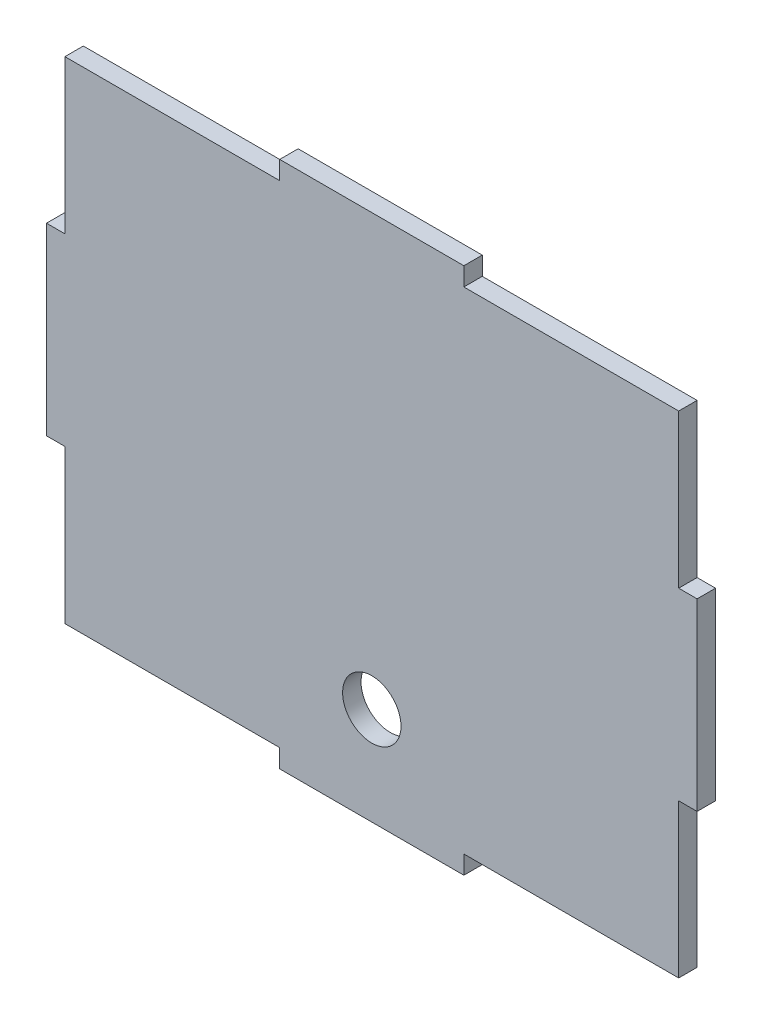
ISO-10303-21;
HEADER;
FILE_DESCRIPTION(('STEP AP214'),'2;1');
FILE_NAME('part.step','',(''),(''),'','','');
FILE_SCHEMA(('AUTOMOTIVE_DESIGN { 1 0 10303 214 1 1 1 1 }'));
ENDSEC;
DATA;
#1=APPLICATION_CONTEXT('core data for automotive mechanical design processes');
#2=APPLICATION_PROTOCOL_DEFINITION('international standard','automotive_design',2000,#1);
#3=PRODUCT_CONTEXT('',#1,'mechanical');
#4=PRODUCT('Part','Part','',(#3));
#5=PRODUCT_RELATED_PRODUCT_CATEGORY('part','',(#4));
#6=PRODUCT_DEFINITION_FORMATION('','',#4);
#7=PRODUCT_DEFINITION_CONTEXT('part definition',#1,'design');
#8=PRODUCT_DEFINITION('design','',#6,#7);
#9=PRODUCT_DEFINITION_SHAPE('','',#8);
#10=(LENGTH_UNIT() NAMED_UNIT(*) SI_UNIT(.MILLI.,.METRE.));
#11=(NAMED_UNIT(*) PLANE_ANGLE_UNIT() SI_UNIT($,.RADIAN.));
#12=(NAMED_UNIT(*) SI_UNIT($,.STERADIAN.) SOLID_ANGLE_UNIT());
#13=UNCERTAINTY_MEASURE_WITH_UNIT(LENGTH_MEASURE(1.E-05),#10,'distance_accuracy_value','');
#14=(GEOMETRIC_REPRESENTATION_CONTEXT(3) GLOBAL_UNCERTAINTY_ASSIGNED_CONTEXT((#13)) GLOBAL_UNIT_ASSIGNED_CONTEXT((#10,
#11,#12)) REPRESENTATION_CONTEXT('',''));
#15=CARTESIAN_POINT('',(0.,0.,0.));
#16=DIRECTION('',(0.,0.,1.));
#17=DIRECTION('',(1.,0.,0.));
#18=AXIS2_PLACEMENT_3D('',#15,#16,#17);
#19=CARTESIAN_POINT('',(0.,0.,3.));
#20=DIRECTION('',(0.,0.,-1.));
#21=DIRECTION('',(-1.,0.,0.));
#22=AXIS2_PLACEMENT_3D('',#19,#20,#21);
#23=PLANE('',#22);
#24=DIRECTION('',(0.,1.,0.));
#25=VECTOR('',#24,1.);
#26=CARTESIAN_POINT('',(50.,15.,3.));
#27=LINE('',#26,#25);
#28=CARTESIAN_POINT('',(50.,15.,3.));
#29=VERTEX_POINT('',#28);
#30=CARTESIAN_POINT('',(50.,40.,3.));
#31=VERTEX_POINT('',#30);
#32=EDGE_CURVE('E241',#29,#31,#27,.T.);
#33=ORIENTED_EDGE('',*,*,#32,.T.);
#34=DIRECTION('',(-1.,0.,0.));
#35=VECTOR('',#34,1.);
#36=CARTESIAN_POINT('',(15.,40.,3.));
#37=LINE('',#36,#35);
#38=CARTESIAN_POINT('',(15.,40.,3.));
#39=VERTEX_POINT('',#38);
#40=EDGE_CURVE('E129',#31,#39,#37,.T.);
#41=ORIENTED_EDGE('',*,*,#40,.T.);
#42=DIRECTION('',(0.,1.,0.));
#43=VECTOR('',#42,1.);
#44=CARTESIAN_POINT('',(15.,40.,3.));
#45=LINE('',#44,#43);
#46=CARTESIAN_POINT('',(15.,43.,3.));
#47=VERTEX_POINT('',#46);
#48=EDGE_CURVE('E292',#39,#47,#45,.T.);
#49=ORIENTED_EDGE('',*,*,#48,.T.);
#50=DIRECTION('',(-1.,0.,0.));
#51=VECTOR('',#50,1.);
#52=CARTESIAN_POINT('',(-15.,43.,3.));
#53=LINE('',#52,#51);
#54=CARTESIAN_POINT('',(-15.,43.,3.));
#55=VERTEX_POINT('',#54);
#56=EDGE_CURVE('E311',#47,#55,#53,.T.);
#57=ORIENTED_EDGE('',*,*,#56,.T.);
#58=DIRECTION('',(0.,-1.,0.));
#59=VECTOR('',#58,1.);
#60=CARTESIAN_POINT('',(-15.,40.,3.));
#61=LINE('',#60,#59);
#62=CARTESIAN_POINT('',(-15.,40.,3.));
#63=VERTEX_POINT('',#62);
#64=EDGE_CURVE('E308',#55,#63,#61,.T.);
#65=ORIENTED_EDGE('',*,*,#64,.T.);
#66=DIRECTION('',(-1.,0.,0.));
#67=VECTOR('',#66,1.);
#68=CARTESIAN_POINT('',(-50.,40.,3.));
#69=LINE('',#68,#67);
#70=CARTESIAN_POINT('',(-50.,40.,3.));
#71=VERTEX_POINT('',#70);
#72=EDGE_CURVE('E310',#63,#71,#69,.T.);
#73=ORIENTED_EDGE('',*,*,#72,.T.);
#74=DIRECTION('',(0.,-1.,0.));
#75=VECTOR('',#74,1.);
#76=CARTESIAN_POINT('',(-50.,15.,3.));
#77=LINE('',#76,#75);
#78=CARTESIAN_POINT('',(-50.,15.,3.));
#79=VERTEX_POINT('',#78);
#80=EDGE_CURVE('E313',#71,#79,#77,.T.);
#81=ORIENTED_EDGE('',*,*,#80,.T.);
#82=DIRECTION('',(-1.,0.,0.));
#83=VECTOR('',#82,1.);
#84=CARTESIAN_POINT('',(-50.,15.,3.));
#85=LINE('',#84,#83);
#86=CARTESIAN_POINT('',(-53.,15.,3.));
#87=VERTEX_POINT('',#86);
#88=EDGE_CURVE('E319',#79,#87,#85,.T.);
#89=ORIENTED_EDGE('',*,*,#88,.T.);
#90=DIRECTION('',(0.,-1.,0.));
#91=VECTOR('',#90,1.);
#92=CARTESIAN_POINT('',(-53.,15.,3.));
#93=LINE('',#92,#91);
#94=CARTESIAN_POINT('',(-53.,-15.,3.));
#95=VERTEX_POINT('',#94);
#96=EDGE_CURVE('E321',#87,#95,#93,.T.);
#97=ORIENTED_EDGE('',*,*,#96,.T.);
#98=DIRECTION('',(1.,0.,0.));
#99=VECTOR('',#98,1.);
#100=CARTESIAN_POINT('',(-50.,-15.,3.));
#101=LINE('',#100,#99);
#102=CARTESIAN_POINT('',(-50.,-15.,3.));
#103=VERTEX_POINT('',#102);
#104=EDGE_CURVE('E323',#95,#103,#101,.T.);
#105=ORIENTED_EDGE('',*,*,#104,.T.);
#106=DIRECTION('',(0.,-1.,0.));
#107=VECTOR('',#106,1.);
#108=CARTESIAN_POINT('',(-50.,-40.,3.));
#109=LINE('',#108,#107);
#110=CARTESIAN_POINT('',(-50.,-40.,3.));
#111=VERTEX_POINT('',#110);
#112=EDGE_CURVE('E325',#103,#111,#109,.T.);
#113=ORIENTED_EDGE('',*,*,#112,.T.);
#114=DIRECTION('',(1.,0.,0.));
#115=VECTOR('',#114,1.);
#116=CARTESIAN_POINT('',(-50.,-40.,3.));
#117=LINE('',#116,#115);
#118=CARTESIAN_POINT('',(-15.,-40.,3.));
#119=VERTEX_POINT('',#118);
#120=EDGE_CURVE('E327',#111,#119,#117,.T.);
#121=ORIENTED_EDGE('',*,*,#120,.T.);
#122=DIRECTION('',(0.,-1.,0.));
#123=VECTOR('',#122,1.);
#124=CARTESIAN_POINT('',(-15.,-40.,3.));
#125=LINE('',#124,#123);
#126=CARTESIAN_POINT('',(-15.,-43.,3.));
#127=VERTEX_POINT('',#126);
#128=EDGE_CURVE('E329',#119,#127,#125,.T.);
#129=ORIENTED_EDGE('',*,*,#128,.T.);
#130=DIRECTION('',(1.,0.,0.));
#131=VECTOR('',#130,1.);
#132=CARTESIAN_POINT('',(-15.,-43.,3.));
#133=LINE('',#132,#131);
#134=CARTESIAN_POINT('',(15.,-43.,3.));
#135=VERTEX_POINT('',#134);
#136=EDGE_CURVE('E331',#127,#135,#133,.T.);
#137=ORIENTED_EDGE('',*,*,#136,.T.);
#138=DIRECTION('',(0.,1.,0.));
#139=VECTOR('',#138,1.);
#140=CARTESIAN_POINT('',(15.,-40.,3.));
#141=LINE('',#140,#139);
#142=CARTESIAN_POINT('',(15.,-40.,3.));
#143=VERTEX_POINT('',#142);
#144=EDGE_CURVE('E333',#135,#143,#141,.T.);
#145=ORIENTED_EDGE('',*,*,#144,.T.);
#146=DIRECTION('',(1.,0.,0.));
#147=VECTOR('',#146,1.);
#148=CARTESIAN_POINT('',(15.,-40.,3.));
#149=LINE('',#148,#147);
#150=CARTESIAN_POINT('',(50.,-40.,3.));
#151=VERTEX_POINT('',#150);
#152=EDGE_CURVE('E335',#143,#151,#149,.T.);
#153=ORIENTED_EDGE('',*,*,#152,.T.);
#154=DIRECTION('',(0.,1.,0.));
#155=VECTOR('',#154,1.);
#156=CARTESIAN_POINT('',(50.,-40.,3.));
#157=LINE('',#156,#155);
#158=CARTESIAN_POINT('',(50.,-15.,3.));
#159=VERTEX_POINT('',#158);
#160=EDGE_CURVE('E184',#151,#159,#157,.T.);
#161=ORIENTED_EDGE('',*,*,#160,.T.);
#162=DIRECTION('',(1.,0.,0.));
#163=VECTOR('',#162,1.);
#164=CARTESIAN_POINT('',(50.,-15.,3.));
#165=LINE('',#164,#163);
#166=CARTESIAN_POINT('',(53.0000000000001,-14.9999999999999,3.));
#167=VERTEX_POINT('',#166);
#168=EDGE_CURVE('E178',#159,#167,#165,.T.);
#169=ORIENTED_EDGE('',*,*,#168,.T.);
#170=DIRECTION('',(0.,1.,0.));
#171=VECTOR('',#170,1.);
#172=CARTESIAN_POINT('',(53.,15.,3.));
#173=LINE('',#172,#171);
#174=CARTESIAN_POINT('',(53.,15.,3.));
#175=VERTEX_POINT('',#174);
#176=EDGE_CURVE('E182',#167,#175,#173,.T.);
#177=ORIENTED_EDGE('',*,*,#176,.T.);
#178=DIRECTION('',(-1.,0.,0.));
#179=VECTOR('',#178,1.);
#180=CARTESIAN_POINT('',(50.,15.,3.));
#181=LINE('',#180,#179);
#182=EDGE_CURVE('E50',#175,#29,#181,.T.);
#183=ORIENTED_EDGE('',*,*,#182,.T.);
#184=EDGE_LOOP('',(#33,#41,#49,#57,#65,#73,#81,#89,#97,#105,#113,#121,#129,#137,#145,#153,#161,
#169,#177,#183));
#185=FACE_BOUND('',#184,.T.);
#186=CARTESIAN_POINT('',(0.,-27.1037288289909,3.));
#187=DIRECTION('',(0.,0.,1.));
#188=DIRECTION('',(1.,0.,0.));
#189=AXIS2_PLACEMENT_3D('',#186,#187,#188);
#190=CIRCLE('',#189,4.755);
#191=CARTESIAN_POINT('',(4.75500000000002,-27.1037288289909,3.));
#192=VERTEX_POINT('',#191);
#193=EDGE_CURVE('E206',#192,#192,#190,.T.);
#194=ORIENTED_EDGE('',*,*,#193,.F.);
#195=EDGE_LOOP('',(#194));
#196=FACE_BOUND('',#195,.T.);
#197=ADVANCED_FACE('F33',(#185,#196),#23,.F.);
#198=CARTESIAN_POINT('',(0.,0.,0.));
#199=DIRECTION('',(0.,0.,-1.));
#200=DIRECTION('',(-1.,0.,0.));
#201=AXIS2_PLACEMENT_3D('',#198,#199,#200);
#202=PLANE('',#201);
#203=DIRECTION('',(0.,1.,0.));
#204=VECTOR('',#203,1.);
#205=CARTESIAN_POINT('',(50.,15.,0.));
#206=LINE('',#205,#204);
#207=CARTESIAN_POINT('',(50.,15.,0.));
#208=VERTEX_POINT('',#207);
#209=CARTESIAN_POINT('',(50.,40.,0.));
#210=VERTEX_POINT('',#209);
#211=EDGE_CURVE('E202',#208,#210,#206,.T.);
#212=ORIENTED_EDGE('',*,*,#211,.F.);
#213=DIRECTION('',(-1.,0.,0.));
#214=VECTOR('',#213,1.);
#215=CARTESIAN_POINT('',(50.,15.,0.));
#216=LINE('',#215,#214);
#217=CARTESIAN_POINT('',(53.,15.,0.));
#218=VERTEX_POINT('',#217);
#219=EDGE_CURVE('E121',#218,#208,#216,.T.);
#220=ORIENTED_EDGE('',*,*,#219,.F.);
#221=DIRECTION('',(0.,1.,0.));
#222=VECTOR('',#221,1.);
#223=CARTESIAN_POINT('',(53.,15.,0.));
#224=LINE('',#223,#222);
#225=CARTESIAN_POINT('',(53.0000000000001,-14.9999999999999,0.));
#226=VERTEX_POINT('',#225);
#227=EDGE_CURVE('E115',#226,#218,#224,.T.);
#228=ORIENTED_EDGE('',*,*,#227,.F.);
#229=DIRECTION('',(1.,0.,0.));
#230=VECTOR('',#229,1.);
#231=CARTESIAN_POINT('',(50.,-15.,0.));
#232=LINE('',#231,#230);
#233=CARTESIAN_POINT('',(50.,-15.,0.));
#234=VERTEX_POINT('',#233);
#235=EDGE_CURVE('E192',#234,#226,#232,.T.);
#236=ORIENTED_EDGE('',*,*,#235,.F.);
#237=DIRECTION('',(0.,1.,0.));
#238=VECTOR('',#237,1.);
#239=CARTESIAN_POINT('',(50.,-40.,0.));
#240=LINE('',#239,#238);
#241=CARTESIAN_POINT('',(50.,-40.,0.));
#242=VERTEX_POINT('',#241);
#243=EDGE_CURVE('E236',#242,#234,#240,.T.);
#244=ORIENTED_EDGE('',*,*,#243,.F.);
#245=DIRECTION('',(1.,0.,0.));
#246=VECTOR('',#245,1.);
#247=CARTESIAN_POINT('',(15.,-40.,0.));
#248=LINE('',#247,#246);
#249=CARTESIAN_POINT('',(15.,-40.,0.));
#250=VERTEX_POINT('',#249);
#251=EDGE_CURVE('E234',#250,#242,#248,.T.);
#252=ORIENTED_EDGE('',*,*,#251,.F.);
#253=DIRECTION('',(0.,1.,0.));
#254=VECTOR('',#253,1.);
#255=CARTESIAN_POINT('',(15.,-40.,0.));
#256=LINE('',#255,#254);
#257=CARTESIAN_POINT('',(15.,-43.,0.));
#258=VERTEX_POINT('',#257);
#259=EDGE_CURVE('E232',#258,#250,#256,.T.);
#260=ORIENTED_EDGE('',*,*,#259,.F.);
#261=DIRECTION('',(1.,0.,0.));
#262=VECTOR('',#261,1.);
#263=CARTESIAN_POINT('',(-15.,-43.,0.));
#264=LINE('',#263,#262);
#265=CARTESIAN_POINT('',(-15.,-43.,0.));
#266=VERTEX_POINT('',#265);
#267=EDGE_CURVE('E230',#266,#258,#264,.T.);
#268=ORIENTED_EDGE('',*,*,#267,.F.);
#269=DIRECTION('',(0.,-1.,0.));
#270=VECTOR('',#269,1.);
#271=CARTESIAN_POINT('',(-15.,-40.,0.));
#272=LINE('',#271,#270);
#273=CARTESIAN_POINT('',(-15.,-40.,0.));
#274=VERTEX_POINT('',#273);
#275=EDGE_CURVE('E228',#274,#266,#272,.T.);
#276=ORIENTED_EDGE('',*,*,#275,.F.);
#277=DIRECTION('',(1.,0.,0.));
#278=VECTOR('',#277,1.);
#279=CARTESIAN_POINT('',(-50.,-40.,0.));
#280=LINE('',#279,#278);
#281=CARTESIAN_POINT('',(-50.,-40.,0.));
#282=VERTEX_POINT('',#281);
#283=EDGE_CURVE('E226',#282,#274,#280,.T.);
#284=ORIENTED_EDGE('',*,*,#283,.F.);
#285=DIRECTION('',(0.,-1.,0.));
#286=VECTOR('',#285,1.);
#287=CARTESIAN_POINT('',(-50.,-40.,0.));
#288=LINE('',#287,#286);
#289=CARTESIAN_POINT('',(-50.,-15.,0.));
#290=VERTEX_POINT('',#289);
#291=EDGE_CURVE('E224',#290,#282,#288,.T.);
#292=ORIENTED_EDGE('',*,*,#291,.F.);
#293=DIRECTION('',(1.,0.,0.));
#294=VECTOR('',#293,1.);
#295=CARTESIAN_POINT('',(-50.,-15.,0.));
#296=LINE('',#295,#294);
#297=CARTESIAN_POINT('',(-53.,-15.,0.));
#298=VERTEX_POINT('',#297);
#299=EDGE_CURVE('E222',#298,#290,#296,.T.);
#300=ORIENTED_EDGE('',*,*,#299,.F.);
#301=DIRECTION('',(0.,-1.,0.));
#302=VECTOR('',#301,1.);
#303=CARTESIAN_POINT('',(-53.,15.,0.));
#304=LINE('',#303,#302);
#305=CARTESIAN_POINT('',(-53.,15.,0.));
#306=VERTEX_POINT('',#305);
#307=EDGE_CURVE('E220',#306,#298,#304,.T.);
#308=ORIENTED_EDGE('',*,*,#307,.F.);
#309=DIRECTION('',(-1.,0.,0.));
#310=VECTOR('',#309,1.);
#311=CARTESIAN_POINT('',(-50.,15.,0.));
#312=LINE('',#311,#310);
#313=CARTESIAN_POINT('',(-50.,15.,0.));
#314=VERTEX_POINT('',#313);
#315=EDGE_CURVE('E218',#314,#306,#312,.T.);
#316=ORIENTED_EDGE('',*,*,#315,.F.);
#317=DIRECTION('',(0.,-1.,0.));
#318=VECTOR('',#317,1.);
#319=CARTESIAN_POINT('',(-50.,15.,0.));
#320=LINE('',#319,#318);
#321=CARTESIAN_POINT('',(-50.,40.,0.));
#322=VERTEX_POINT('',#321);
#323=EDGE_CURVE('E216',#322,#314,#320,.T.);
#324=ORIENTED_EDGE('',*,*,#323,.F.);
#325=DIRECTION('',(-1.,0.,0.));
#326=VECTOR('',#325,1.);
#327=CARTESIAN_POINT('',(-50.,40.,0.));
#328=LINE('',#327,#326);
#329=CARTESIAN_POINT('',(-15.,40.,0.));
#330=VERTEX_POINT('',#329);
#331=EDGE_CURVE('E214',#330,#322,#328,.T.);
#332=ORIENTED_EDGE('',*,*,#331,.F.);
#333=DIRECTION('',(0.,-1.,0.));
#334=VECTOR('',#333,1.);
#335=CARTESIAN_POINT('',(-15.,40.,0.));
#336=LINE('',#335,#334);
#337=CARTESIAN_POINT('',(-15.,43.,0.));
#338=VERTEX_POINT('',#337);
#339=EDGE_CURVE('E212',#338,#330,#336,.T.);
#340=ORIENTED_EDGE('',*,*,#339,.F.);
#341=DIRECTION('',(-1.,0.,0.));
#342=VECTOR('',#341,1.);
#343=CARTESIAN_POINT('',(-15.,43.,0.));
#344=LINE('',#343,#342);
#345=CARTESIAN_POINT('',(15.,43.,0.));
#346=VERTEX_POINT('',#345);
#347=EDGE_CURVE('E210',#346,#338,#344,.T.);
#348=ORIENTED_EDGE('',*,*,#347,.F.);
#349=DIRECTION('',(0.,1.,0.));
#350=VECTOR('',#349,1.);
#351=CARTESIAN_POINT('',(15.,40.,0.));
#352=LINE('',#351,#350);
#353=CARTESIAN_POINT('',(15.,40.,0.));
#354=VERTEX_POINT('',#353);
#355=EDGE_CURVE('E208',#354,#346,#352,.T.);
#356=ORIENTED_EDGE('',*,*,#355,.F.);
#357=DIRECTION('',(-1.,0.,0.));
#358=VECTOR('',#357,1.);
#359=CARTESIAN_POINT('',(15.,40.,0.));
#360=LINE('',#359,#358);
#361=EDGE_CURVE('E205',#210,#354,#360,.T.);
#362=ORIENTED_EDGE('',*,*,#361,.F.);
#363=EDGE_LOOP('',(#212,#220,#228,#236,#244,#252,#260,#268,#276,#284,#292,#300,#308,#316,#324,
#332,#340,#348,#356,#362));
#364=FACE_BOUND('',#363,.T.);
#365=CARTESIAN_POINT('',(0.,-27.1037288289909,0.));
#366=DIRECTION('',(0.,0.,1.));
#367=DIRECTION('',(1.,0.,0.));
#368=AXIS2_PLACEMENT_3D('',#365,#366,#367);
#369=CIRCLE('',#368,4.755);
#370=CARTESIAN_POINT('',(4.75500000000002,-27.1037288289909,0.));
#371=VERTEX_POINT('',#370);
#372=EDGE_CURVE('E586',#371,#371,#369,.T.);
#373=ORIENTED_EDGE('',*,*,#372,.T.);
#374=EDGE_LOOP('',(#373));
#375=FACE_BOUND('',#374,.T.);
#376=ADVANCED_FACE('F296',(#364,#375),#202,.T.);
#377=CARTESIAN_POINT('',(50.,15.,3.));
#378=DIRECTION('',(-1.,0.,0.));
#379=DIRECTION('',(0.,-1.,0.));
#380=AXIS2_PLACEMENT_3D('',#377,#378,#379);
#381=PLANE('',#380);
#382=ORIENTED_EDGE('',*,*,#211,.T.);
#383=DIRECTION('',(0.,0.,-1.));
#384=VECTOR('',#383,1.);
#385=CARTESIAN_POINT('',(50.,40.,3.));
#386=LINE('',#385,#384);
#387=EDGE_CURVE('E11',#31,#210,#386,.T.);
#388=ORIENTED_EDGE('',*,*,#387,.F.);
#389=ORIENTED_EDGE('',*,*,#32,.F.);
#390=DIRECTION('',(0.,0.,-1.));
#391=VECTOR('',#390,1.);
#392=CARTESIAN_POINT('',(50.,15.,3.));
#393=LINE('',#392,#391);
#394=EDGE_CURVE('E198',#29,#208,#393,.T.);
#395=ORIENTED_EDGE('',*,*,#394,.T.);
#396=EDGE_LOOP('',(#382,#388,#389,#395));
#397=FACE_BOUND('',#396,.T.);
#398=ADVANCED_FACE('F35',(#397),#381,.F.);
#399=CARTESIAN_POINT('',(15.,40.,3.));
#400=DIRECTION('',(0.,-1.,0.));
#401=DIRECTION('',(0.,0.,-1.));
#402=AXIS2_PLACEMENT_3D('',#399,#400,#401);
#403=PLANE('',#402);
#404=ORIENTED_EDGE('',*,*,#361,.T.);
#405=DIRECTION('',(0.,0.,-1.));
#406=VECTOR('',#405,1.);
#407=CARTESIAN_POINT('',(15.,40.,3.));
#408=LINE('',#407,#406);
#409=EDGE_CURVE('E42',#39,#354,#408,.T.);
#410=ORIENTED_EDGE('',*,*,#409,.F.);
#411=ORIENTED_EDGE('',*,*,#40,.F.);
#412=ORIENTED_EDGE('',*,*,#387,.T.);
#413=EDGE_LOOP('',(#404,#410,#411,#412));
#414=FACE_BOUND('',#413,.T.);
#415=ADVANCED_FACE('F369',(#414),#403,.F.);
#416=CARTESIAN_POINT('',(15.,40.,3.));
#417=DIRECTION('',(-1.,0.,0.));
#418=DIRECTION('',(0.,-1.,0.));
#419=AXIS2_PLACEMENT_3D('',#416,#417,#418);
#420=PLANE('',#419);
#421=ORIENTED_EDGE('',*,*,#355,.T.);
#422=DIRECTION('',(0.,0.,-1.));
#423=VECTOR('',#422,1.);
#424=CARTESIAN_POINT('',(15.,43.,3.));
#425=LINE('',#424,#423);
#426=EDGE_CURVE('E284',#47,#346,#425,.T.);
#427=ORIENTED_EDGE('',*,*,#426,.F.);
#428=ORIENTED_EDGE('',*,*,#48,.F.);
#429=ORIENTED_EDGE('',*,*,#409,.T.);
#430=EDGE_LOOP('',(#421,#427,#428,#429));
#431=FACE_BOUND('',#430,.T.);
#432=ADVANCED_FACE('F290',(#431),#420,.F.);
#433=CARTESIAN_POINT('',(-15.,43.,3.));
#434=DIRECTION('',(0.,-1.,0.));
#435=DIRECTION('',(0.,0.,-1.));
#436=AXIS2_PLACEMENT_3D('',#433,#434,#435);
#437=PLANE('',#436);
#438=ORIENTED_EDGE('',*,*,#347,.T.);
#439=DIRECTION('',(0.,0.,-1.));
#440=VECTOR('',#439,1.);
#441=CARTESIAN_POINT('',(-15.,43.,3.));
#442=LINE('',#441,#440);
#443=EDGE_CURVE('E281',#55,#338,#442,.T.);
#444=ORIENTED_EDGE('',*,*,#443,.F.);
#445=ORIENTED_EDGE('',*,*,#56,.F.);
#446=ORIENTED_EDGE('',*,*,#426,.T.);
#447=EDGE_LOOP('',(#438,#444,#445,#446));
#448=FACE_BOUND('',#447,.T.);
#449=ADVANCED_FACE('F302',(#448),#437,.F.);
#450=CARTESIAN_POINT('',(-15.,40.,3.));
#451=DIRECTION('',(1.,0.,0.));
#452=DIRECTION('',(0.,1.,0.));
#453=AXIS2_PLACEMENT_3D('',#450,#451,#452);
#454=PLANE('',#453);
#455=ORIENTED_EDGE('',*,*,#339,.T.);
#456=DIRECTION('',(0.,0.,-1.));
#457=VECTOR('',#456,1.);
#458=CARTESIAN_POINT('',(-15.,40.,3.));
#459=LINE('',#458,#457);
#460=EDGE_CURVE('E278',#63,#330,#459,.T.);
#461=ORIENTED_EDGE('',*,*,#460,.F.);
#462=ORIENTED_EDGE('',*,*,#64,.F.);
#463=ORIENTED_EDGE('',*,*,#443,.T.);
#464=EDGE_LOOP('',(#455,#461,#462,#463));
#465=FACE_BOUND('',#464,.T.);
#466=ADVANCED_FACE('F306',(#465),#454,.F.);
#467=CARTESIAN_POINT('',(-50.,40.,3.));
#468=DIRECTION('',(0.,-1.,0.));
#469=DIRECTION('',(0.,0.,-1.));
#470=AXIS2_PLACEMENT_3D('',#467,#468,#469);
#471=PLANE('',#470);
#472=ORIENTED_EDGE('',*,*,#331,.T.);
#473=DIRECTION('',(0.,0.,-1.));
#474=VECTOR('',#473,1.);
#475=CARTESIAN_POINT('',(-50.,40.,3.));
#476=LINE('',#475,#474);
#477=EDGE_CURVE('E275',#71,#322,#476,.T.);
#478=ORIENTED_EDGE('',*,*,#477,.F.);
#479=ORIENTED_EDGE('',*,*,#72,.F.);
#480=ORIENTED_EDGE('',*,*,#460,.T.);
#481=EDGE_LOOP('',(#472,#478,#479,#480));
#482=FACE_BOUND('',#481,.T.);
#483=ADVANCED_FACE('F382',(#482),#471,.F.);
#484=CARTESIAN_POINT('',(-50.,15.,3.));
#485=DIRECTION('',(1.,0.,0.));
#486=DIRECTION('',(0.,1.,0.));
#487=AXIS2_PLACEMENT_3D('',#484,#485,#486);
#488=PLANE('',#487);
#489=ORIENTED_EDGE('',*,*,#323,.T.);
#490=DIRECTION('',(0.,0.,-1.));
#491=VECTOR('',#490,1.);
#492=CARTESIAN_POINT('',(-50.,15.,3.));
#493=LINE('',#492,#491);
#494=EDGE_CURVE('E272',#79,#314,#493,.T.);
#495=ORIENTED_EDGE('',*,*,#494,.F.);
#496=ORIENTED_EDGE('',*,*,#80,.F.);
#497=ORIENTED_EDGE('',*,*,#477,.T.);
#498=EDGE_LOOP('',(#489,#495,#496,#497));
#499=FACE_BOUND('',#498,.T.);
#500=ADVANCED_FACE('F385',(#499),#488,.F.);
#501=CARTESIAN_POINT('',(-50.,15.,3.));
#502=DIRECTION('',(0.,-1.,0.));
#503=DIRECTION('',(1.,0.,0.));
#504=AXIS2_PLACEMENT_3D('',#501,#502,#503);
#505=PLANE('',#504);
#506=ORIENTED_EDGE('',*,*,#315,.T.);
#507=DIRECTION('',(0.,0.,-1.));
#508=VECTOR('',#507,1.);
#509=CARTESIAN_POINT('',(-53.,15.,3.));
#510=LINE('',#509,#508);
#511=EDGE_CURVE('E269',#87,#306,#510,.T.);
#512=ORIENTED_EDGE('',*,*,#511,.F.);
#513=ORIENTED_EDGE('',*,*,#88,.F.);
#514=ORIENTED_EDGE('',*,*,#494,.T.);
#515=EDGE_LOOP('',(#506,#512,#513,#514));
#516=FACE_BOUND('',#515,.T.);
#517=ADVANCED_FACE('F389',(#516),#505,.F.);
#518=CARTESIAN_POINT('',(-53.,15.,3.));
#519=DIRECTION('',(1.,0.,0.));
#520=DIRECTION('',(0.,1.,0.));
#521=AXIS2_PLACEMENT_3D('',#518,#519,#520);
#522=PLANE('',#521);
#523=ORIENTED_EDGE('',*,*,#307,.T.);
#524=DIRECTION('',(0.,0.,-1.));
#525=VECTOR('',#524,1.);
#526=CARTESIAN_POINT('',(-53.,-15.,3.));
#527=LINE('',#526,#525);
#528=EDGE_CURVE('E266',#95,#298,#527,.T.);
#529=ORIENTED_EDGE('',*,*,#528,.F.);
#530=ORIENTED_EDGE('',*,*,#96,.F.);
#531=ORIENTED_EDGE('',*,*,#511,.T.);
#532=EDGE_LOOP('',(#523,#529,#530,#531));
#533=FACE_BOUND('',#532,.T.);
#534=ADVANCED_FACE('F393',(#533),#522,.F.);
#535=CARTESIAN_POINT('',(-50.,-15.,3.));
#536=DIRECTION('',(0.,1.,0.));
#537=DIRECTION('',(0.,0.,1.));
#538=AXIS2_PLACEMENT_3D('',#535,#536,#537);
#539=PLANE('',#538);
#540=ORIENTED_EDGE('',*,*,#299,.T.);
#541=DIRECTION('',(0.,0.,-1.));
#542=VECTOR('',#541,1.);
#543=CARTESIAN_POINT('',(-50.,-15.,3.));
#544=LINE('',#543,#542);
#545=EDGE_CURVE('E263',#103,#290,#544,.T.);
#546=ORIENTED_EDGE('',*,*,#545,.F.);
#547=ORIENTED_EDGE('',*,*,#104,.F.);
#548=ORIENTED_EDGE('',*,*,#528,.T.);
#549=EDGE_LOOP('',(#540,#546,#547,#548));
#550=FACE_BOUND('',#549,.T.);
#551=ADVANCED_FACE('F397',(#550),#539,.F.);
#552=CARTESIAN_POINT('',(-50.,-40.,3.));
#553=DIRECTION('',(1.,0.,0.));
#554=DIRECTION('',(0.,1.,0.));
#555=AXIS2_PLACEMENT_3D('',#552,#553,#554);
#556=PLANE('',#555);
#557=ORIENTED_EDGE('',*,*,#291,.T.);
#558=DIRECTION('',(0.,0.,-1.));
#559=VECTOR('',#558,1.);
#560=CARTESIAN_POINT('',(-50.,-40.,3.));
#561=LINE('',#560,#559);
#562=EDGE_CURVE('E260',#111,#282,#561,.T.);
#563=ORIENTED_EDGE('',*,*,#562,.F.);
#564=ORIENTED_EDGE('',*,*,#112,.F.);
#565=ORIENTED_EDGE('',*,*,#545,.T.);
#566=EDGE_LOOP('',(#557,#563,#564,#565));
#567=FACE_BOUND('',#566,.T.);
#568=ADVANCED_FACE('F401',(#567),#556,.F.);
#569=CARTESIAN_POINT('',(-50.,-40.,3.));
#570=DIRECTION('',(0.,1.,0.));
#571=DIRECTION('',(-1.,0.,0.));
#572=AXIS2_PLACEMENT_3D('',#569,#570,#571);
#573=PLANE('',#572);
#574=ORIENTED_EDGE('',*,*,#283,.T.);
#575=DIRECTION('',(0.,0.,-1.));
#576=VECTOR('',#575,1.);
#577=CARTESIAN_POINT('',(-15.,-40.,3.));
#578=LINE('',#577,#576);
#579=EDGE_CURVE('E257',#119,#274,#578,.T.);
#580=ORIENTED_EDGE('',*,*,#579,.F.);
#581=ORIENTED_EDGE('',*,*,#120,.F.);
#582=ORIENTED_EDGE('',*,*,#562,.T.);
#583=EDGE_LOOP('',(#574,#580,#581,#582));
#584=FACE_BOUND('',#583,.T.);
#585=ADVANCED_FACE('F405',(#584),#573,.F.);
#586=CARTESIAN_POINT('',(-15.,-40.,3.));
#587=DIRECTION('',(1.,0.,0.));
#588=DIRECTION('',(0.,1.,0.));
#589=AXIS2_PLACEMENT_3D('',#586,#587,#588);
#590=PLANE('',#589);
#591=ORIENTED_EDGE('',*,*,#275,.T.);
#592=DIRECTION('',(0.,0.,-1.));
#593=VECTOR('',#592,1.);
#594=CARTESIAN_POINT('',(-15.,-43.,3.));
#595=LINE('',#594,#593);
#596=EDGE_CURVE('E254',#127,#266,#595,.T.);
#597=ORIENTED_EDGE('',*,*,#596,.F.);
#598=ORIENTED_EDGE('',*,*,#128,.F.);
#599=ORIENTED_EDGE('',*,*,#579,.T.);
#600=EDGE_LOOP('',(#591,#597,#598,#599));
#601=FACE_BOUND('',#600,.T.);
#602=ADVANCED_FACE('F409',(#601),#590,.F.);
#603=CARTESIAN_POINT('',(-15.,-43.,3.));
#604=DIRECTION('',(0.,1.,0.));
#605=DIRECTION('',(0.,0.,1.));
#606=AXIS2_PLACEMENT_3D('',#603,#604,#605);
#607=PLANE('',#606);
#608=ORIENTED_EDGE('',*,*,#267,.T.);
#609=DIRECTION('',(0.,0.,-1.));
#610=VECTOR('',#609,1.);
#611=CARTESIAN_POINT('',(15.,-43.,3.));
#612=LINE('',#611,#610);
#613=EDGE_CURVE('E251',#135,#258,#612,.T.);
#614=ORIENTED_EDGE('',*,*,#613,.F.);
#615=ORIENTED_EDGE('',*,*,#136,.F.);
#616=ORIENTED_EDGE('',*,*,#596,.T.);
#617=EDGE_LOOP('',(#608,#614,#615,#616));
#618=FACE_BOUND('',#617,.T.);
#619=ADVANCED_FACE('F413',(#618),#607,.F.);
#620=CARTESIAN_POINT('',(15.,-40.,3.));
#621=DIRECTION('',(-1.,0.,0.));
#622=DIRECTION('',(0.,-1.,0.));
#623=AXIS2_PLACEMENT_3D('',#620,#621,#622);
#624=PLANE('',#623);
#625=ORIENTED_EDGE('',*,*,#259,.T.);
#626=DIRECTION('',(0.,0.,-1.));
#627=VECTOR('',#626,1.);
#628=CARTESIAN_POINT('',(15.,-40.,3.));
#629=LINE('',#628,#627);
#630=EDGE_CURVE('E248',#143,#250,#629,.T.);
#631=ORIENTED_EDGE('',*,*,#630,.F.);
#632=ORIENTED_EDGE('',*,*,#144,.F.);
#633=ORIENTED_EDGE('',*,*,#613,.T.);
#634=EDGE_LOOP('',(#625,#631,#632,#633));
#635=FACE_BOUND('',#634,.T.);
#636=ADVANCED_FACE('F417',(#635),#624,.F.);
#637=CARTESIAN_POINT('',(15.,-40.,3.));
#638=DIRECTION('',(0.,1.,0.));
#639=DIRECTION('',(-1.,0.,0.));
#640=AXIS2_PLACEMENT_3D('',#637,#638,#639);
#641=PLANE('',#640);
#642=ORIENTED_EDGE('',*,*,#251,.T.);
#643=DIRECTION('',(0.,0.,-1.));
#644=VECTOR('',#643,1.);
#645=CARTESIAN_POINT('',(50.,-40.,3.));
#646=LINE('',#645,#644);
#647=EDGE_CURVE('E245',#151,#242,#646,.T.);
#648=ORIENTED_EDGE('',*,*,#647,.F.);
#649=ORIENTED_EDGE('',*,*,#152,.F.);
#650=ORIENTED_EDGE('',*,*,#630,.T.);
#651=EDGE_LOOP('',(#642,#648,#649,#650));
#652=FACE_BOUND('',#651,.T.);
#653=ADVANCED_FACE('F341',(#652),#641,.F.);
#654=CARTESIAN_POINT('',(50.,-40.,3.));
#655=DIRECTION('',(-1.,0.,0.));
#656=DIRECTION('',(0.,-1.,0.));
#657=AXIS2_PLACEMENT_3D('',#654,#655,#656);
#658=PLANE('',#657);
#659=ORIENTED_EDGE('',*,*,#243,.T.);
#660=DIRECTION('',(0.,0.,-1.));
#661=VECTOR('',#660,1.);
#662=CARTESIAN_POINT('',(50.,-15.,3.));
#663=LINE('',#662,#661);
#664=EDGE_CURVE('E193',#159,#234,#663,.T.);
#665=ORIENTED_EDGE('',*,*,#664,.F.);
#666=ORIENTED_EDGE('',*,*,#160,.F.);
#667=ORIENTED_EDGE('',*,*,#647,.T.);
#668=EDGE_LOOP('',(#659,#665,#666,#667));
#669=FACE_BOUND('',#668,.T.);
#670=ADVANCED_FACE('F345',(#669),#658,.F.);
#671=CARTESIAN_POINT('',(50.,-15.,3.));
#672=DIRECTION('',(0.,1.,0.));
#673=DIRECTION('',(-1.,0.,0.));
#674=AXIS2_PLACEMENT_3D('',#671,#672,#673);
#675=PLANE('',#674);
#676=ORIENTED_EDGE('',*,*,#235,.T.);
#677=DIRECTION('',(0.,0.,-1.));
#678=VECTOR('',#677,1.);
#679=CARTESIAN_POINT('',(53.0000000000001,-14.9999999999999,3.));
#680=LINE('',#679,#678);
#681=EDGE_CURVE('E189',#167,#226,#680,.T.);
#682=ORIENTED_EDGE('',*,*,#681,.F.);
#683=ORIENTED_EDGE('',*,*,#168,.F.);
#684=ORIENTED_EDGE('',*,*,#664,.T.);
#685=EDGE_LOOP('',(#676,#682,#683,#684));
#686=FACE_BOUND('',#685,.T.);
#687=ADVANCED_FACE('F190',(#686),#675,.F.);
#688=CARTESIAN_POINT('',(53.,15.,3.));
#689=DIRECTION('',(-1.,0.,0.));
#690=DIRECTION('',(0.,-1.,0.));
#691=AXIS2_PLACEMENT_3D('',#688,#689,#690);
#692=PLANE('',#691);
#693=ORIENTED_EDGE('',*,*,#227,.T.);
#694=DIRECTION('',(0.,0.,-1.));
#695=VECTOR('',#694,1.);
#696=CARTESIAN_POINT('',(53.,15.,3.));
#697=LINE('',#696,#695);
#698=EDGE_CURVE('E194',#175,#218,#697,.T.);
#699=ORIENTED_EDGE('',*,*,#698,.F.);
#700=ORIENTED_EDGE('',*,*,#176,.F.);
#701=ORIENTED_EDGE('',*,*,#681,.T.);
#702=EDGE_LOOP('',(#693,#699,#700,#701));
#703=FACE_BOUND('',#702,.T.);
#704=ADVANCED_FACE('F196',(#703),#692,.F.);
#705=CARTESIAN_POINT('',(50.,15.,3.));
#706=DIRECTION('',(0.,-1.,0.));
#707=DIRECTION('',(1.,0.,0.));
#708=AXIS2_PLACEMENT_3D('',#705,#706,#707);
#709=PLANE('',#708);
#710=ORIENTED_EDGE('',*,*,#219,.T.);
#711=ORIENTED_EDGE('',*,*,#394,.F.);
#712=ORIENTED_EDGE('',*,*,#182,.F.);
#713=ORIENTED_EDGE('',*,*,#698,.T.);
#714=EDGE_LOOP('',(#710,#711,#712,#713));
#715=FACE_BOUND('',#714,.T.);
#716=ADVANCED_FACE('F349',(#715),#709,.F.);
#717=CARTESIAN_POINT('',(0.,-27.1037288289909,3.));
#718=DIRECTION('',(0.,0.,-1.));
#719=DIRECTION('',(-1.,0.,0.));
#720=AXIS2_PLACEMENT_3D('',#717,#718,#719);
#721=CYLINDRICAL_SURFACE('',#720,4.755);
#722=ORIENTED_EDGE('',*,*,#193,.T.);
#723=EDGE_LOOP('',(#722));
#724=FACE_BOUND('',#723,.T.);
#725=ORIENTED_EDGE('',*,*,#372,.F.);
#726=EDGE_LOOP('',(#725));
#727=FACE_BOUND('',#726,.T.);
#728=ADVANCED_FACE('F351',(#724,#727),#721,.F.);
#729=CLOSED_SHELL('',(#197,#376,#398,#415,#432,#449,#466,#483,#500,#517,#534,#551,#568,#585,
#602,#619,#636,#653,#670,#687,#704,#716,#728));
#730=MANIFOLD_SOLID_BREP('B2',#729);
#731=ADVANCED_BREP_SHAPE_REPRESENTATION('',(#18,#730),#14);
#732=SHAPE_DEFINITION_REPRESENTATION(#9,#731);
ENDSEC;
END-ISO-10303-21;
